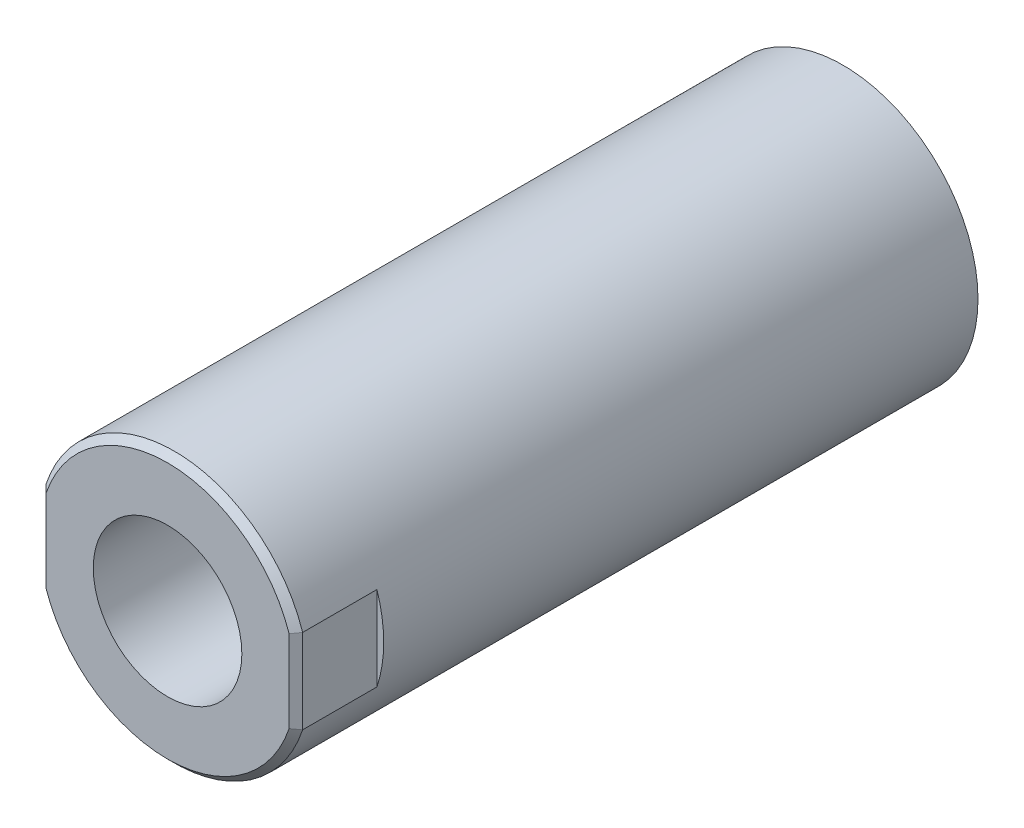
ISO-10303-21;
HEADER;
FILE_DESCRIPTION(('STEP AP214'),'2;1');
FILE_NAME('part.step','',(''),(''),'','','');
FILE_SCHEMA(('AUTOMOTIVE_DESIGN { 1 0 10303 214 1 1 1 1 }'));
ENDSEC;
DATA;
#1=APPLICATION_CONTEXT('core data for automotive mechanical design processes');
#2=APPLICATION_PROTOCOL_DEFINITION('international standard','automotive_design',2000,#1);
#3=PRODUCT_CONTEXT('',#1,'mechanical');
#4=PRODUCT('Part','Part','',(#3));
#5=PRODUCT_RELATED_PRODUCT_CATEGORY('part','',(#4));
#6=PRODUCT_DEFINITION_FORMATION('','',#4);
#7=PRODUCT_DEFINITION_CONTEXT('part definition',#1,'design');
#8=PRODUCT_DEFINITION('design','',#6,#7);
#9=PRODUCT_DEFINITION_SHAPE('','',#8);
#10=(LENGTH_UNIT() NAMED_UNIT(*) SI_UNIT(.MILLI.,.METRE.));
#11=(NAMED_UNIT(*) PLANE_ANGLE_UNIT() SI_UNIT($,.RADIAN.));
#12=(NAMED_UNIT(*) SI_UNIT($,.STERADIAN.) SOLID_ANGLE_UNIT());
#13=UNCERTAINTY_MEASURE_WITH_UNIT(LENGTH_MEASURE(1.E-05),#10,'distance_accuracy_value','');
#14=(GEOMETRIC_REPRESENTATION_CONTEXT(3) GLOBAL_UNCERTAINTY_ASSIGNED_CONTEXT((#13)) GLOBAL_UNIT_ASSIGNED_CONTEXT((#10,
#11,#12)) REPRESENTATION_CONTEXT('',''));
#15=CARTESIAN_POINT('',(0.,0.,0.));
#16=DIRECTION('',(0.,0.,1.));
#17=DIRECTION('',(1.,0.,0.));
#18=AXIS2_PLACEMENT_3D('',#15,#16,#17);
#19=CARTESIAN_POINT('',(0.,0.,-100.));
#20=DIRECTION('',(0.,0.,1.));
#21=DIRECTION('',(1.,0.,0.));
#22=AXIS2_PLACEMENT_3D('',#19,#20,#21);
#23=PLANE('',#22);
#24=CARTESIAN_POINT('',(0.,0.,-100.));
#25=DIRECTION('',(0.,0.,1.));
#26=DIRECTION('',(1.,0.,0.));
#27=AXIS2_PLACEMENT_3D('',#24,#25,#26);
#28=CIRCLE('',#27,20.);
#29=CARTESIAN_POINT('',(20.,0.,-100.));
#30=VERTEX_POINT('',#29);
#31=EDGE_CURVE('E208',#30,#30,#28,.T.);
#32=ORIENTED_EDGE('',*,*,#31,.F.);
#33=EDGE_LOOP('',(#32));
#34=FACE_BOUND('',#33,.T.);
#35=ADVANCED_FACE('F37',(#34),#23,.F.);
#36=CARTESIAN_POINT('',(19.,-10.5,-12.));
#37=DIRECTION('',(0.,0.,-1.));
#38=DIRECTION('',(-1.,0.,0.));
#39=AXIS2_PLACEMENT_3D('',#36,#37,#38);
#40=PLANE('',#39);
#41=CARTESIAN_POINT('',(0.,0.,-12.));
#42=DIRECTION('',(0.,0.,-1.));
#43=DIRECTION('',(-1.,0.,0.));
#44=AXIS2_PLACEMENT_3D('',#41,#42,#43);
#45=CIRCLE('',#44,20.);
#46=CARTESIAN_POINT('',(19.,-6.24499799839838,-12.));
#47=VERTEX_POINT('',#46);
#48=CARTESIAN_POINT('',(19.,6.24499799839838,-12.));
#49=VERTEX_POINT('',#48);
#50=EDGE_CURVE('E211',#47,#49,#45,.F.);
#51=ORIENTED_EDGE('',*,*,#50,.T.);
#52=DIRECTION('',(0.,1.,0.));
#53=VECTOR('',#52,1.);
#54=CARTESIAN_POINT('',(19.,-10.5,-12.));
#55=LINE('',#54,#53);
#56=EDGE_CURVE('E112',#47,#49,#55,.T.);
#57=ORIENTED_EDGE('',*,*,#56,.F.);
#58=EDGE_LOOP('',(#51,#57));
#59=FACE_BOUND('',#58,.T.);
#60=ADVANCED_FACE('F168',(#59),#40,.F.);
#61=CARTESIAN_POINT('',(-21.5,-10.5,-12.));
#62=DIRECTION('',(0.,0.,-1.));
#63=DIRECTION('',(-1.,0.,0.));
#64=AXIS2_PLACEMENT_3D('',#61,#62,#63);
#65=PLANE('',#64);
#66=CARTESIAN_POINT('',(0.,0.,-12.));
#67=DIRECTION('',(0.,0.,-1.));
#68=DIRECTION('',(-1.,0.,0.));
#69=AXIS2_PLACEMENT_3D('',#66,#67,#68);
#70=CIRCLE('',#69,20.);
#71=CARTESIAN_POINT('',(-19.,6.2449979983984,-12.));
#72=VERTEX_POINT('',#71);
#73=CARTESIAN_POINT('',(-19.,-6.2449979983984,-12.));
#74=VERTEX_POINT('',#73);
#75=EDGE_CURVE('E107',#72,#74,#70,.F.);
#76=ORIENTED_EDGE('',*,*,#75,.T.);
#77=DIRECTION('',(0.,1.,0.));
#78=VECTOR('',#77,1.);
#79=CARTESIAN_POINT('',(-19.,-10.5,-12.));
#80=LINE('',#79,#78);
#81=EDGE_CURVE('E102',#74,#72,#80,.T.);
#82=ORIENTED_EDGE('',*,*,#81,.T.);
#83=EDGE_LOOP('',(#76,#82));
#84=FACE_BOUND('',#83,.T.);
#85=ADVANCED_FACE('F110',(#84),#65,.F.);
#86=CARTESIAN_POINT('',(0.,0.,-100.));
#87=DIRECTION('',(0.,0.,1.));
#88=DIRECTION('',(1.,0.,0.));
#89=AXIS2_PLACEMENT_3D('',#86,#87,#88);
#90=CYLINDRICAL_SURFACE('',#89,20.);
#91=DIRECTION('',(0.,0.,1.));
#92=VECTOR('',#91,1.);
#93=CARTESIAN_POINT('',(19.,-6.24499799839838,-100.));
#94=LINE('',#93,#92);
#95=CARTESIAN_POINT('',(19.,-6.24499799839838,-1.));
#96=VERTEX_POINT('',#95);
#97=EDGE_CURVE('E119',#96,#47,#94,.F.);
#98=ORIENTED_EDGE('',*,*,#97,.F.);
#99=CARTESIAN_POINT('',(0.,0.,-1.));
#100=DIRECTION('',(0.,0.,1.));
#101=DIRECTION('',(1.,0.,0.));
#102=AXIS2_PLACEMENT_3D('',#99,#100,#101);
#103=CIRCLE('',#102,20.);
#104=CARTESIAN_POINT('',(-19.,-6.2449979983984,-1.));
#105=VERTEX_POINT('',#104);
#106=EDGE_CURVE('E50',#96,#105,#103,.F.);
#107=ORIENTED_EDGE('',*,*,#106,.T.);
#108=DIRECTION('',(0.,0.,1.));
#109=VECTOR('',#108,1.);
#110=CARTESIAN_POINT('',(-19.,-6.2449979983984,-100.));
#111=LINE('',#110,#109);
#112=EDGE_CURVE('E117',#74,#105,#111,.T.);
#113=ORIENTED_EDGE('',*,*,#112,.F.);
#114=ORIENTED_EDGE('',*,*,#75,.F.);
#115=DIRECTION('',(0.,0.,1.));
#116=VECTOR('',#115,1.);
#117=CARTESIAN_POINT('',(-19.,6.2449979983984,-100.));
#118=LINE('',#117,#116);
#119=CARTESIAN_POINT('',(-19.,6.2449979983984,-1.));
#120=VERTEX_POINT('',#119);
#121=EDGE_CURVE('E98',#120,#72,#118,.F.);
#122=ORIENTED_EDGE('',*,*,#121,.F.);
#123=CARTESIAN_POINT('',(0.,0.,-1.));
#124=DIRECTION('',(0.,0.,1.));
#125=DIRECTION('',(1.,0.,0.));
#126=AXIS2_PLACEMENT_3D('',#123,#124,#125);
#127=CIRCLE('',#126,20.);
#128=CARTESIAN_POINT('',(19.,6.24499799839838,-1.));
#129=VERTEX_POINT('',#128);
#130=EDGE_CURVE('E64',#120,#129,#127,.F.);
#131=ORIENTED_EDGE('',*,*,#130,.T.);
#132=DIRECTION('',(0.,0.,1.));
#133=VECTOR('',#132,1.);
#134=CARTESIAN_POINT('',(19.,6.24499799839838,-100.));
#135=LINE('',#134,#133);
#136=EDGE_CURVE('E217',#49,#129,#135,.T.);
#137=ORIENTED_EDGE('',*,*,#136,.F.);
#138=ORIENTED_EDGE('',*,*,#50,.F.);
#139=EDGE_LOOP('',(#98,#107,#113,#114,#122,#131,#137,#138));
#140=FACE_BOUND('',#139,.T.);
#141=ORIENTED_EDGE('',*,*,#31,.T.);
#142=EDGE_LOOP('',(#141));
#143=FACE_BOUND('',#142,.T.);
#144=ADVANCED_FACE('F115',(#140,#143),#90,.T.);
#145=CARTESIAN_POINT('',(19.,-10.5,0.));
#146=DIRECTION('',(-1.,0.,0.));
#147=DIRECTION('',(0.,0.,1.));
#148=AXIS2_PLACEMENT_3D('',#145,#146,#147);
#149=PLANE('',#148);
#150=ORIENTED_EDGE('',*,*,#136,.T.);
#151=DIRECTION('',(0.,-1.,0.));
#152=VECTOR('',#151,1.);
#153=CARTESIAN_POINT('',(19.,-6.24499799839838,-0.999999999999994));
#154=LINE('',#153,#152);
#155=EDGE_CURVE('E11',#129,#96,#154,.T.);
#156=ORIENTED_EDGE('',*,*,#155,.T.);
#157=ORIENTED_EDGE('',*,*,#97,.T.);
#158=ORIENTED_EDGE('',*,*,#56,.T.);
#159=EDGE_LOOP('',(#150,#156,#157,#158));
#160=FACE_BOUND('',#159,.T.);
#161=ADVANCED_FACE('F181',(#160),#149,.F.);
#162=CARTESIAN_POINT('',(-19.,-10.5,0.));
#163=DIRECTION('',(1.,0.,0.));
#164=DIRECTION('',(0.,0.,-1.));
#165=AXIS2_PLACEMENT_3D('',#162,#163,#164);
#166=PLANE('',#165);
#167=ORIENTED_EDGE('',*,*,#112,.T.);
#168=DIRECTION('',(0.,1.,0.));
#169=VECTOR('',#168,1.);
#170=CARTESIAN_POINT('',(-19.,6.2449979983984,-0.999999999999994));
#171=LINE('',#170,#169);
#172=EDGE_CURVE('E105',#105,#120,#171,.T.);
#173=ORIENTED_EDGE('',*,*,#172,.T.);
#174=ORIENTED_EDGE('',*,*,#121,.T.);
#175=ORIENTED_EDGE('',*,*,#81,.F.);
#176=EDGE_LOOP('',(#167,#173,#174,#175));
#177=FACE_BOUND('',#176,.T.);
#178=ADVANCED_FACE('F101',(#177),#166,.F.);
#179=CARTESIAN_POINT('',(0.,0.,0.));
#180=DIRECTION('',(0.,0.,1.));
#181=DIRECTION('',(1.,0.,0.));
#182=AXIS2_PLACEMENT_3D('',#179,#180,#181);
#183=PLANE('',#182);
#184=CARTESIAN_POINT('',(0.,0.,0.));
#185=DIRECTION('',(0.,0.,1.));
#186=DIRECTION('',(1.,0.,0.));
#187=AXIS2_PLACEMENT_3D('',#184,#185,#186);
#188=CIRCLE('',#187,19.);
#189=CARTESIAN_POINT('',(18.,6.08276253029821,0.));
#190=VERTEX_POINT('',#189);
#191=CARTESIAN_POINT('',(-18.,6.08276253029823,0.));
#192=VERTEX_POINT('',#191);
#193=EDGE_CURVE('E124',#190,#192,#188,.T.);
#194=ORIENTED_EDGE('',*,*,#193,.T.);
#195=DIRECTION('',(0.,-1.,0.));
#196=VECTOR('',#195,1.);
#197=CARTESIAN_POINT('',(-18.,-6.2449979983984,0.));
#198=LINE('',#197,#196);
#199=CARTESIAN_POINT('',(-18.,-6.08276253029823,0.));
#200=VERTEX_POINT('',#199);
#201=EDGE_CURVE('E130',#192,#200,#198,.T.);
#202=ORIENTED_EDGE('',*,*,#201,.T.);
#203=CARTESIAN_POINT('',(0.,0.,0.));
#204=DIRECTION('',(0.,0.,1.));
#205=DIRECTION('',(1.,0.,0.));
#206=AXIS2_PLACEMENT_3D('',#203,#204,#205);
#207=CIRCLE('',#206,19.);
#208=CARTESIAN_POINT('',(18.,-6.08276253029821,0.));
#209=VERTEX_POINT('',#208);
#210=EDGE_CURVE('E128',#200,#209,#207,.T.);
#211=ORIENTED_EDGE('',*,*,#210,.T.);
#212=DIRECTION('',(0.,1.,0.));
#213=VECTOR('',#212,1.);
#214=CARTESIAN_POINT('',(18.,6.24499799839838,0.));
#215=LINE('',#214,#213);
#216=EDGE_CURVE('E126',#209,#190,#215,.T.);
#217=ORIENTED_EDGE('',*,*,#216,.T.);
#218=EDGE_LOOP('',(#194,#202,#211,#217));
#219=FACE_BOUND('',#218,.T.);
#220=CARTESIAN_POINT('',(0.,0.,0.));
#221=DIRECTION('',(0.,0.,-1.));
#222=DIRECTION('',(-1.,0.,0.));
#223=AXIS2_PLACEMENT_3D('',#220,#221,#222);
#224=CIRCLE('',#223,11.);
#225=CARTESIAN_POINT('',(-11.,0.,0.));
#226=VERTEX_POINT('',#225);
#227=EDGE_CURVE('E113',#226,#226,#224,.F.);
#228=ORIENTED_EDGE('',*,*,#227,.F.);
#229=EDGE_LOOP('',(#228));
#230=FACE_BOUND('',#229,.T.);
#231=ADVANCED_FACE('F193',(#219,#230),#183,.T.);
#232=CARTESIAN_POINT('',(0.,0.,15.));
#233=DIRECTION('',(0.,0.,1.));
#234=DIRECTION('',(1.,0.,0.));
#235=AXIS2_PLACEMENT_3D('',#232,#233,#234);
#236=CYLINDRICAL_SURFACE('',#235,11.);
#237=ORIENTED_EDGE('',*,*,#227,.T.);
#238=EDGE_LOOP('',(#237));
#239=FACE_BOUND('',#238,.T.);
#240=CARTESIAN_POINT('',(0.,0.,-39.));
#241=DIRECTION('',(0.,0.,1.));
#242=DIRECTION('',(1.,0.,0.));
#243=AXIS2_PLACEMENT_3D('',#240,#241,#242);
#244=CIRCLE('',#243,11.);
#245=CARTESIAN_POINT('',(11.,0.,-39.));
#246=VERTEX_POINT('',#245);
#247=EDGE_CURVE('E206',#246,#246,#244,.T.);
#248=ORIENTED_EDGE('',*,*,#247,.F.);
#249=EDGE_LOOP('',(#248));
#250=FACE_BOUND('',#249,.T.);
#251=ADVANCED_FACE('F178',(#239,#250),#236,.F.);
#252=CARTESIAN_POINT('',(0.,0.,-39.));
#253=DIRECTION('',(0.,0.,1.));
#254=DIRECTION('',(1.,0.,0.));
#255=AXIS2_PLACEMENT_3D('',#252,#253,#254);
#256=CONICAL_SURFACE('',#255,11.,1.02974425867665);
#257=CARTESIAN_POINT('',(0.,0.,-45.6094668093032));
#258=VERTEX_POINT('',#257);
#259=VERTEX_LOOP('',#258);
#260=FACE_BOUND('',#259,.T.);
#261=ORIENTED_EDGE('',*,*,#247,.T.);
#262=EDGE_LOOP('',(#261));
#263=FACE_BOUND('',#262,.T.);
#264=ADVANCED_FACE('F164',(#260,#263),#256,.F.);
#265=CARTESIAN_POINT('',(18.,0.,0.));
#266=DIRECTION('',(0.707106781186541,0.,0.707106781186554));
#267=DIRECTION('',(0.707106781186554,0.,-0.707106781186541));
#268=AXIS2_PLACEMENT_3D('',#265,#266,#267);
#269=PLANE('',#268);
#270=CARTESIAN_POINT('',(18.,6.08276253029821,0.));
#271=CARTESIAN_POINT('',(18.1666381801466,6.11015297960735,-0.166638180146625));
#272=CARTESIAN_POINT('',(18.3332906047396,6.13736782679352,-0.333290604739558));
#273=CARTESIAN_POINT('',(18.6666239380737,6.19144631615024,-0.666623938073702));
#274=CARTESIAN_POINT('',(18.8333048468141,6.21830995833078,-0.833304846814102));
#275=CARTESIAN_POINT('',(19.,6.24499799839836,-0.999999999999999));
#276=B_SPLINE_CURVE_WITH_KNOTS('',3,(#270,#271,#272,#273,#274,#275),.UNSPECIFIED.,.F.,.F.,(4,2,
4),(0.,0.711744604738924,1.42348918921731),.UNSPECIFIED.);
#277=EDGE_CURVE('E224',#190,#129,#276,.T.);
#278=ORIENTED_EDGE('',*,*,#277,.F.);
#279=ORIENTED_EDGE('',*,*,#216,.F.);
#280=CARTESIAN_POINT('',(18.,-6.08276253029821,0.));
#281=CARTESIAN_POINT('',(18.1666381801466,-6.11015297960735,-0.166638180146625));
#282=CARTESIAN_POINT('',(18.3332906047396,-6.13736782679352,-0.333290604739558));
#283=CARTESIAN_POINT('',(18.6666239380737,-6.19144631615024,-0.666623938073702));
#284=CARTESIAN_POINT('',(18.8333048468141,-6.21830995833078,-0.833304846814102));
#285=CARTESIAN_POINT('',(19.,-6.24499799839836,-0.999999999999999));
#286=B_SPLINE_CURVE_WITH_KNOTS('',3,(#280,#281,#282,#283,#284,#285),.UNSPECIFIED.,.F.,.F.,(4,2,
4),(0.,0.711744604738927,1.42348918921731),.UNSPECIFIED.);
#287=EDGE_CURVE('E42',#96,#209,#286,.F.);
#288=ORIENTED_EDGE('',*,*,#287,.F.);
#289=ORIENTED_EDGE('',*,*,#155,.F.);
#290=EDGE_LOOP('',(#278,#279,#288,#289));
#291=FACE_BOUND('',#290,.T.);
#292=ADVANCED_FACE('F39',(#291),#269,.T.);
#293=CARTESIAN_POINT('',(0.,0.,0.));
#294=DIRECTION('',(0.,0.,-1.));
#295=DIRECTION('',(-1.,0.,0.));
#296=AXIS2_PLACEMENT_3D('',#293,#294,#295);
#297=CONICAL_SURFACE('',#296,19.,0.785398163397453);
#298=ORIENTED_EDGE('',*,*,#287,.T.);
#299=ORIENTED_EDGE('',*,*,#210,.F.);
#300=CARTESIAN_POINT('',(-18.,-6.08276253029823,0.));
#301=CARTESIAN_POINT('',(-18.1666381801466,-6.11015297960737,-0.166638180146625));
#302=CARTESIAN_POINT('',(-18.3332906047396,-6.13736782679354,-0.333290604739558));
#303=CARTESIAN_POINT('',(-18.6666239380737,-6.19144631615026,-0.666623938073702));
#304=CARTESIAN_POINT('',(-18.8333048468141,-6.21830995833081,-0.833304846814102));
#305=CARTESIAN_POINT('',(-19.,-6.24499799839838,-0.999999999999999));
#306=B_SPLINE_CURVE_WITH_KNOTS('',3,(#300,#301,#302,#303,#304,#305),.UNSPECIFIED.,.F.,.F.,(4,2,
4),(0.,0.711744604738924,1.42348918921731),.UNSPECIFIED.);
#307=EDGE_CURVE('E142',#105,#200,#306,.F.);
#308=ORIENTED_EDGE('',*,*,#307,.F.);
#309=ORIENTED_EDGE('',*,*,#106,.F.);
#310=EDGE_LOOP('',(#298,#299,#308,#309));
#311=FACE_BOUND('',#310,.T.);
#312=ADVANCED_FACE('F153',(#311),#297,.T.);
#313=CARTESIAN_POINT('',(0.,0.,0.));
#314=DIRECTION('',(0.,0.,-1.));
#315=DIRECTION('',(-1.,0.,0.));
#316=AXIS2_PLACEMENT_3D('',#313,#314,#315);
#317=CONICAL_SURFACE('',#316,19.,0.785398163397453);
#318=ORIENTED_EDGE('',*,*,#277,.T.);
#319=ORIENTED_EDGE('',*,*,#130,.F.);
#320=CARTESIAN_POINT('',(-19.,6.2449979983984,-1.));
#321=CARTESIAN_POINT('',(-18.8333048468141,6.21830995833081,-0.833304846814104));
#322=CARTESIAN_POINT('',(-18.6666239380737,6.19144631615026,-0.666623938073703));
#323=CARTESIAN_POINT('',(-18.3332906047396,6.13736782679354,-0.333290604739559));
#324=CARTESIAN_POINT('',(-18.1666381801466,6.11015297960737,-0.166638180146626));
#325=CARTESIAN_POINT('',(-18.,6.08276253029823,0.));
#326=B_SPLINE_CURVE_WITH_KNOTS('',3,(#320,#321,#322,#323,#324,#325),.UNSPECIFIED.,.F.,.F.,(4,2,
4),(0.,0.711744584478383,1.42348918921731),.UNSPECIFIED.);
#327=EDGE_CURVE('E135',#192,#120,#326,.F.);
#328=ORIENTED_EDGE('',*,*,#327,.F.);
#329=ORIENTED_EDGE('',*,*,#193,.F.);
#330=EDGE_LOOP('',(#318,#319,#328,#329));
#331=FACE_BOUND('',#330,.T.);
#332=ADVANCED_FACE('F146',(#331),#317,.T.);
#333=CARTESIAN_POINT('',(-19.,-10.5,-0.999999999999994));
#334=DIRECTION('',(-0.707106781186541,0.,0.707106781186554));
#335=DIRECTION('',(0.707106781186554,0.,0.707106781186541));
#336=AXIS2_PLACEMENT_3D('',#333,#334,#335);
#337=PLANE('',#336);
#338=ORIENTED_EDGE('',*,*,#307,.T.);
#339=ORIENTED_EDGE('',*,*,#201,.F.);
#340=ORIENTED_EDGE('',*,*,#327,.T.);
#341=ORIENTED_EDGE('',*,*,#172,.F.);
#342=EDGE_LOOP('',(#338,#339,#340,#341));
#343=FACE_BOUND('',#342,.T.);
#344=ADVANCED_FACE('F149',(#343),#337,.T.);
#345=CLOSED_SHELL('',(#35,#60,#85,#144,#161,#178,#231,#251,#264,#292,#312,#332,#344));
#346=MANIFOLD_SOLID_BREP('B2',#345);
#347=ADVANCED_BREP_SHAPE_REPRESENTATION('',(#18,#346),#14);
#348=SHAPE_DEFINITION_REPRESENTATION(#9,#347);
ENDSEC;
END-ISO-10303-21;
